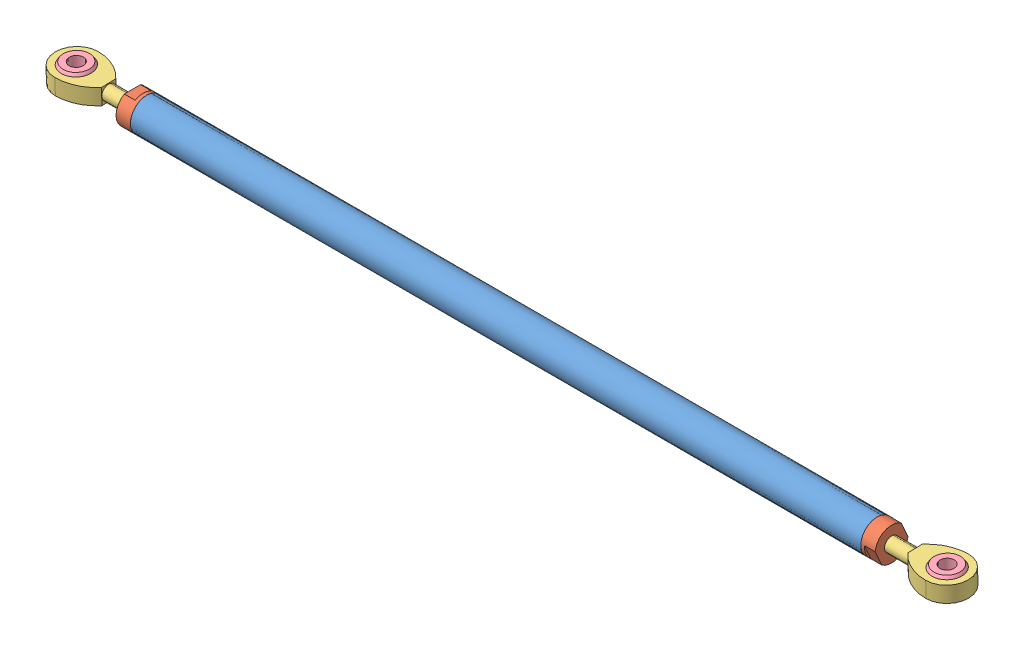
SolidWorks assembly Tie Rod Assembly_Final.SLDASM, configuration Default (file format 13000). Lengths in mm.
Overall size (405.13 19.3 19.32).
9 component instances, 4 part files, 7 mates.
Components (placement in the parent):
- Tie Rod Tube - CF_Final-1: Tie Rod Tube - CF_Final.SLDPRT [Default] at origin size (323.85 14.58 14.58)
- Pull Rod Plug_Final-1: Pull Rod Plug_Final.SLDPRT [Default] at (-168.275 0 0) x (0 0 1) z (-1 0 0) size (14.61 14.61 35.88)
- Pull Rod Plug_Final-2: Pull Rod Plug_Final.SLDPRT [Default] at (168.275 0 0) x (0 -0.9126 -0.408853) z (1 0 0) size (14.61 14.61 35.88)
- Rod End Assembly_Final-1: Rod End Assembly_Final.SLDASM [Default] at (193.04 0 0) x (1 0 0) z (0 -0.028657 0.999589) size (49.23 9.53 19.05)
  - Rod End Outter_Final-1: Rod End Outter_Final.SLDPRT [Default] at origin size (49.23 7.14 19.05)
  - Spherical - Inner_Final-1: Spherical - Inner_Final.SLDPRT [Default] at origin size (15.06 9.53 15.06)
- Rod End Assembly_Final-2: Rod End Assembly_Final.SLDASM [Default] at (-193.04 0 0) x (-1 0 0) z (0 -0.028657 0.999589) size (49.23 9.53 19.05)
  - Rod End Outter_Final-1: Rod End Outter_Final.SLDPRT [Default] at origin size (49.23 7.14 19.05)
  - Spherical - Inner_Final-1: Spherical - Inner_Final.SLDPRT [Default] at origin size (15.06 9.53 15.06)
Mates (geometry in assembly coordinates):
- Concentric1: concentric anti-aligned: cylinder of Tie Rod Tube - CF_Final-1 through (88.8575 0 0) axis (1 0 0) radius 6.35; cylinder of Pull Rod Plug_Final-1 through (-136.525 0 0) axis (-1 0 0) radius 6.1468
- Coincident11: coincident anti-aligned: plane of Tie Rod Tube - CF_Final-1 through (-161.925 7.2898 0) normal (-1 0 0); plane of Pull Rod Plug_Final-1 through (-161.925 0 0) normal (1 0 0)
- Concentric2: concentric aligned: cylinder of Tie Rod Tube - CF_Final-1 through (88.8575 0 0) axis (1 0 0) radius 6.35; cylinder of Pull Rod Plug_Final-2 through (136.525 0 0) axis (1 0 0) radius 6.1468
- Coincident10: coincident anti-aligned: plane of Tie Rod Tube - CF_Final-1 through (161.925 6.35 0) normal (1 0 0); plane of Pull Rod Plug_Final-2 through (161.925 0 0) normal (-1 0 0)
- Concentric3: concentric aligned: cylinder of Tie Rod Tube - CF_Final-1 through (88.8575 0 0) axis (1 0 0) radius 7.2898; cylinder of Rod End Assembly_Final-1/Rod End Outter_Final-1 through (153.3398 0 0) axis (1 0 0) radius 3.175
- Concentric4: concentric anti-aligned: cylinder of Tie Rod Tube - CF_Final-1 through (88.8575 0 0) axis (1 0 0) radius 7.2898; cylinder of Rod End Assembly_Final-2/Rod End Outter_Final-1 through (-153.3398 0 0) axis (-1 0 0) radius 3.175
- Coincident8: coincident anti-aligned: plane of Rod End Assembly_Final-1 through (193.04 0 0) normal (0 0.999589 0.028657); plane of Rod End Assembly_Final-2 through (-193.04 0 0) normal (0 -0.999589 -0.028657)
